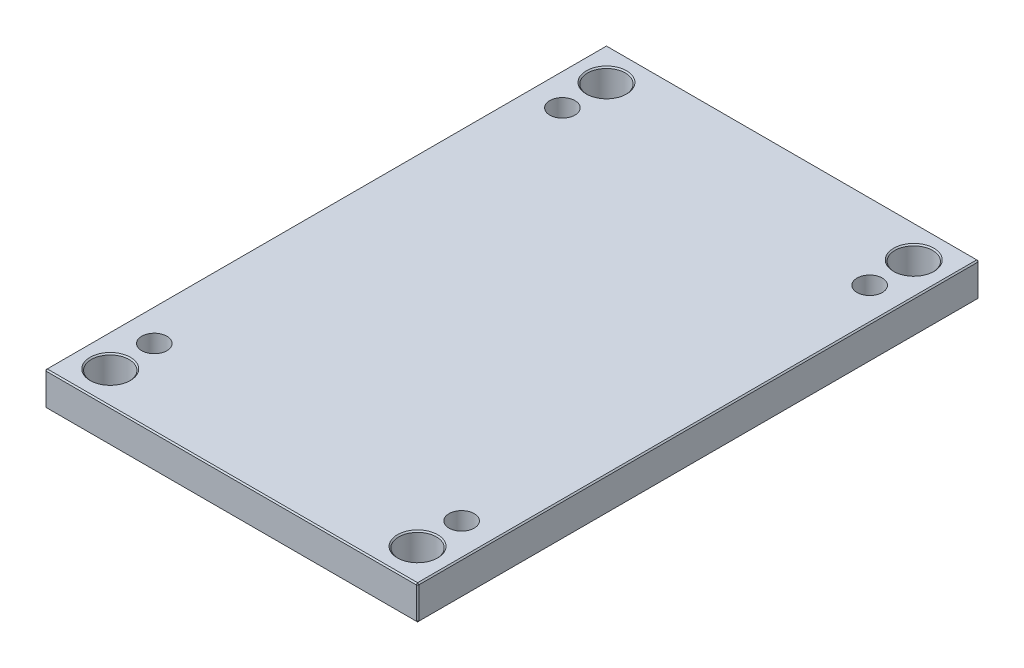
ISO-10303-21;
HEADER;
FILE_DESCRIPTION(('STEP AP214'),'2;1');
FILE_NAME('part.step','',(''),(''),'','','');
FILE_SCHEMA(('AUTOMOTIVE_DESIGN { 1 0 10303 214 1 1 1 1 }'));
ENDSEC;
DATA;
#1=APPLICATION_CONTEXT('core data for automotive mechanical design processes');
#2=APPLICATION_PROTOCOL_DEFINITION('international standard','automotive_design',2000,#1);
#3=PRODUCT_CONTEXT('',#1,'mechanical');
#4=PRODUCT('Part','Part','',(#3));
#5=PRODUCT_RELATED_PRODUCT_CATEGORY('part','',(#4));
#6=PRODUCT_DEFINITION_FORMATION('','',#4);
#7=PRODUCT_DEFINITION_CONTEXT('part definition',#1,'design');
#8=PRODUCT_DEFINITION('design','',#6,#7);
#9=PRODUCT_DEFINITION_SHAPE('','',#8);
#10=(LENGTH_UNIT() NAMED_UNIT(*) SI_UNIT(.MILLI.,.METRE.));
#11=(NAMED_UNIT(*) PLANE_ANGLE_UNIT() SI_UNIT($,.RADIAN.));
#12=(NAMED_UNIT(*) SI_UNIT($,.STERADIAN.) SOLID_ANGLE_UNIT());
#13=UNCERTAINTY_MEASURE_WITH_UNIT(LENGTH_MEASURE(1.E-05),#10,'distance_accuracy_value','');
#14=(GEOMETRIC_REPRESENTATION_CONTEXT(3) GLOBAL_UNCERTAINTY_ASSIGNED_CONTEXT((#13)) GLOBAL_UNIT_ASSIGNED_CONTEXT((#10,
#11,#12)) REPRESENTATION_CONTEXT('',''));
#15=CARTESIAN_POINT('',(0.,0.,0.));
#16=DIRECTION('',(0.,0.,1.));
#17=DIRECTION('',(1.,0.,0.));
#18=AXIS2_PLACEMENT_3D('',#15,#16,#17);
#19=CARTESIAN_POINT('',(-122.,0.,-162.));
#20=DIRECTION('',(0.,1.,0.));
#21=DIRECTION('',(0.,0.,1.));
#22=AXIS2_PLACEMENT_3D('',#19,#20,#21);
#23=CYLINDRICAL_SURFACE('',#22,6.);
#24=CARTESIAN_POINT('',(-122.,0.,-162.));
#25=DIRECTION('',(0.,1.,0.));
#26=DIRECTION('',(0.,0.,1.));
#27=AXIS2_PLACEMENT_3D('',#24,#25,#26);
#28=CIRCLE('',#27,6.);
#29=CARTESIAN_POINT('',(-122.,0.,-156.));
#30=VERTEX_POINT('',#29);
#31=EDGE_CURVE('E150',#30,#30,#28,.T.);
#32=ORIENTED_EDGE('',*,*,#31,.F.);
#33=EDGE_LOOP('',(#32));
#34=FACE_BOUND('',#33,.T.);
#35=CARTESIAN_POINT('',(-122.,13.,-162.));
#36=DIRECTION('',(0.,1.,0.));
#37=DIRECTION('',(0.,0.,1.));
#38=AXIS2_PLACEMENT_3D('',#35,#36,#37);
#39=CIRCLE('',#38,6.);
#40=CARTESIAN_POINT('',(-122.,13.,-156.));
#41=VERTEX_POINT('',#40);
#42=EDGE_CURVE('E20',#41,#41,#39,.F.);
#43=ORIENTED_EDGE('',*,*,#42,.F.);
#44=EDGE_LOOP('',(#43));
#45=FACE_BOUND('',#44,.T.);
#46=ADVANCED_FACE('F16',(#34,#45),#23,.F.);
#47=CARTESIAN_POINT('',(122.,0.,-162.));
#48=DIRECTION('',(0.,1.,0.));
#49=DIRECTION('',(0.,0.,1.));
#50=AXIS2_PLACEMENT_3D('',#47,#48,#49);
#51=CYLINDRICAL_SURFACE('',#50,6.);
#52=CARTESIAN_POINT('',(122.,0.,-162.));
#53=DIRECTION('',(0.,1.,0.));
#54=DIRECTION('',(0.,0.,1.));
#55=AXIS2_PLACEMENT_3D('',#52,#53,#54);
#56=CIRCLE('',#55,6.);
#57=CARTESIAN_POINT('',(122.,0.,-156.));
#58=VERTEX_POINT('',#57);
#59=EDGE_CURVE('E307',#58,#58,#56,.T.);
#60=ORIENTED_EDGE('',*,*,#59,.F.);
#61=EDGE_LOOP('',(#60));
#62=FACE_BOUND('',#61,.T.);
#63=CARTESIAN_POINT('',(122.,13.,-162.));
#64=DIRECTION('',(0.,1.,0.));
#65=DIRECTION('',(0.,0.,1.));
#66=AXIS2_PLACEMENT_3D('',#63,#64,#65);
#67=CIRCLE('',#66,6.);
#68=CARTESIAN_POINT('',(122.,13.,-156.));
#69=VERTEX_POINT('',#68);
#70=EDGE_CURVE('E294',#69,#69,#67,.F.);
#71=ORIENTED_EDGE('',*,*,#70,.F.);
#72=EDGE_LOOP('',(#71));
#73=FACE_BOUND('',#72,.T.);
#74=ADVANCED_FACE('F473',(#62,#73),#51,.F.);
#75=CARTESIAN_POINT('',(122.,0.,162.));
#76=DIRECTION('',(0.,1.,0.));
#77=DIRECTION('',(0.,0.,1.));
#78=AXIS2_PLACEMENT_3D('',#75,#76,#77);
#79=CYLINDRICAL_SURFACE('',#78,6.);
#80=CARTESIAN_POINT('',(122.,0.,162.));
#81=DIRECTION('',(0.,1.,0.));
#82=DIRECTION('',(0.,0.,1.));
#83=AXIS2_PLACEMENT_3D('',#80,#81,#82);
#84=CIRCLE('',#83,6.);
#85=CARTESIAN_POINT('',(122.,0.,168.));
#86=VERTEX_POINT('',#85);
#87=EDGE_CURVE('E303',#86,#86,#84,.T.);
#88=ORIENTED_EDGE('',*,*,#87,.F.);
#89=EDGE_LOOP('',(#88));
#90=FACE_BOUND('',#89,.T.);
#91=CARTESIAN_POINT('',(122.,13.,162.));
#92=DIRECTION('',(0.,1.,0.));
#93=DIRECTION('',(0.,0.,1.));
#94=AXIS2_PLACEMENT_3D('',#91,#92,#93);
#95=CIRCLE('',#94,6.);
#96=CARTESIAN_POINT('',(122.,13.,168.));
#97=VERTEX_POINT('',#96);
#98=EDGE_CURVE('E291',#97,#97,#95,.F.);
#99=ORIENTED_EDGE('',*,*,#98,.F.);
#100=EDGE_LOOP('',(#99));
#101=FACE_BOUND('',#100,.T.);
#102=ADVANCED_FACE('F480',(#90,#101),#79,.F.);
#103=CARTESIAN_POINT('',(-122.,0.,162.));
#104=DIRECTION('',(0.,1.,0.));
#105=DIRECTION('',(0.,0.,1.));
#106=AXIS2_PLACEMENT_3D('',#103,#104,#105);
#107=CYLINDRICAL_SURFACE('',#106,6.);
#108=CARTESIAN_POINT('',(-122.,0.,162.));
#109=DIRECTION('',(0.,1.,0.));
#110=DIRECTION('',(0.,0.,1.));
#111=AXIS2_PLACEMENT_3D('',#108,#109,#110);
#112=CIRCLE('',#111,6.);
#113=CARTESIAN_POINT('',(-122.,0.,168.));
#114=VERTEX_POINT('',#113);
#115=EDGE_CURVE('E299',#114,#114,#112,.T.);
#116=ORIENTED_EDGE('',*,*,#115,.F.);
#117=EDGE_LOOP('',(#116));
#118=FACE_BOUND('',#117,.T.);
#119=CARTESIAN_POINT('',(-122.,13.,162.));
#120=DIRECTION('',(0.,1.,0.));
#121=DIRECTION('',(0.,0.,1.));
#122=AXIS2_PLACEMENT_3D('',#119,#120,#121);
#123=CIRCLE('',#122,6.);
#124=CARTESIAN_POINT('',(-122.,13.,168.));
#125=VERTEX_POINT('',#124);
#126=EDGE_CURVE('E288',#125,#125,#123,.F.);
#127=ORIENTED_EDGE('',*,*,#126,.F.);
#128=EDGE_LOOP('',(#127));
#129=FACE_BOUND('',#128,.T.);
#130=ADVANCED_FACE('F485',(#118,#129),#107,.F.);
#131=CARTESIAN_POINT('',(-148.,27.,223.));
#132=DIRECTION('',(1.,0.,0.));
#133=DIRECTION('',(0.,0.,-1.));
#134=AXIS2_PLACEMENT_3D('',#131,#132,#133);
#135=PLANE('',#134);
#136=DIRECTION('',(0.,-1.,0.));
#137=VECTOR('',#136,1.);
#138=CARTESIAN_POINT('',(-148.,27.,-222.));
#139=LINE('',#138,#137);
#140=CARTESIAN_POINT('',(-148.,26.,-222.));
#141=VERTEX_POINT('',#140);
#142=CARTESIAN_POINT('',(-148.,1.,-222.));
#143=VERTEX_POINT('',#142);
#144=EDGE_CURVE('E118',#141,#143,#139,.T.);
#145=ORIENTED_EDGE('',*,*,#144,.T.);
#146=DIRECTION('',(0.,0.,1.));
#147=VECTOR('',#146,1.);
#148=CARTESIAN_POINT('',(-148.,1.,223.));
#149=LINE('',#148,#147);
#150=CARTESIAN_POINT('',(-148.,1.,222.));
#151=VERTEX_POINT('',#150);
#152=EDGE_CURVE('E114',#143,#151,#149,.T.);
#153=ORIENTED_EDGE('',*,*,#152,.T.);
#154=DIRECTION('',(0.,1.,0.));
#155=VECTOR('',#154,1.);
#156=CARTESIAN_POINT('',(-148.,27.,222.));
#157=LINE('',#156,#155);
#158=CARTESIAN_POINT('',(-148.,26.,222.));
#159=VERTEX_POINT('',#158);
#160=EDGE_CURVE('E106',#151,#159,#157,.T.);
#161=ORIENTED_EDGE('',*,*,#160,.T.);
#162=DIRECTION('',(0.,0.,-1.));
#163=VECTOR('',#162,1.);
#164=CARTESIAN_POINT('',(-148.,26.,-223.));
#165=LINE('',#164,#163);
#166=EDGE_CURVE('E111',#159,#141,#165,.T.);
#167=ORIENTED_EDGE('',*,*,#166,.T.);
#168=EDGE_LOOP('',(#145,#153,#161,#167));
#169=FACE_BOUND('',#168,.T.);
#170=ADVANCED_FACE('F109',(#169),#135,.F.);
#171=CARTESIAN_POINT('',(148.,27.,223.));
#172=DIRECTION('',(0.,0.,-1.));
#173=DIRECTION('',(-1.,0.,0.));
#174=AXIS2_PLACEMENT_3D('',#171,#172,#173);
#175=PLANE('',#174);
#176=DIRECTION('',(-1.,0.,0.));
#177=VECTOR('',#176,1.);
#178=CARTESIAN_POINT('',(-148.,26.,223.));
#179=LINE('',#178,#177);
#180=CARTESIAN_POINT('',(147.,26.,223.));
#181=VERTEX_POINT('',#180);
#182=CARTESIAN_POINT('',(-147.,26.,223.));
#183=VERTEX_POINT('',#182);
#184=EDGE_CURVE('E173',#181,#183,#179,.T.);
#185=ORIENTED_EDGE('',*,*,#184,.T.);
#186=DIRECTION('',(0.,-1.,0.));
#187=VECTOR('',#186,1.);
#188=CARTESIAN_POINT('',(-147.,27.,223.));
#189=LINE('',#188,#187);
#190=CARTESIAN_POINT('',(-147.,0.999999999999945,223.));
#191=VERTEX_POINT('',#190);
#192=EDGE_CURVE('E126',#183,#191,#189,.T.);
#193=ORIENTED_EDGE('',*,*,#192,.T.);
#194=DIRECTION('',(1.,0.,0.));
#195=VECTOR('',#194,1.);
#196=CARTESIAN_POINT('',(148.,0.999999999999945,223.));
#197=LINE('',#196,#195);
#198=CARTESIAN_POINT('',(147.,0.999999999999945,223.));
#199=VERTEX_POINT('',#198);
#200=EDGE_CURVE('E177',#191,#199,#197,.T.);
#201=ORIENTED_EDGE('',*,*,#200,.T.);
#202=DIRECTION('',(0.,1.,0.));
#203=VECTOR('',#202,1.);
#204=CARTESIAN_POINT('',(147.,27.,223.));
#205=LINE('',#204,#203);
#206=EDGE_CURVE('E175',#199,#181,#205,.T.);
#207=ORIENTED_EDGE('',*,*,#206,.T.);
#208=EDGE_LOOP('',(#185,#193,#201,#207));
#209=FACE_BOUND('',#208,.T.);
#210=ADVANCED_FACE('F438',(#209),#175,.F.);
#211=CARTESIAN_POINT('',(148.,27.,223.));
#212=DIRECTION('',(-1.,0.,0.));
#213=DIRECTION('',(0.,0.,1.));
#214=AXIS2_PLACEMENT_3D('',#211,#212,#213);
#215=PLANE('',#214);
#216=DIRECTION('',(0.,0.,-1.));
#217=VECTOR('',#216,1.);
#218=CARTESIAN_POINT('',(148.,0.999999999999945,223.));
#219=LINE('',#218,#217);
#220=CARTESIAN_POINT('',(148.,0.999999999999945,222.));
#221=VERTEX_POINT('',#220);
#222=CARTESIAN_POINT('',(148.,0.999999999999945,-222.));
#223=VERTEX_POINT('',#222);
#224=EDGE_CURVE('E168',#221,#223,#219,.T.);
#225=ORIENTED_EDGE('',*,*,#224,.T.);
#226=DIRECTION('',(0.,1.,0.));
#227=VECTOR('',#226,1.);
#228=CARTESIAN_POINT('',(148.,27.,-222.));
#229=LINE('',#228,#227);
#230=CARTESIAN_POINT('',(148.,26.,-222.));
#231=VERTEX_POINT('',#230);
#232=EDGE_CURVE('E170',#223,#231,#229,.T.);
#233=ORIENTED_EDGE('',*,*,#232,.T.);
#234=DIRECTION('',(0.,0.,1.));
#235=VECTOR('',#234,1.);
#236=CARTESIAN_POINT('',(148.,26.,223.));
#237=LINE('',#236,#235);
#238=CARTESIAN_POINT('',(148.,26.,222.));
#239=VERTEX_POINT('',#238);
#240=EDGE_CURVE('E164',#231,#239,#237,.T.);
#241=ORIENTED_EDGE('',*,*,#240,.T.);
#242=DIRECTION('',(0.,-1.,0.));
#243=VECTOR('',#242,1.);
#244=CARTESIAN_POINT('',(148.,27.,222.));
#245=LINE('',#244,#243);
#246=EDGE_CURVE('E166',#239,#221,#245,.T.);
#247=ORIENTED_EDGE('',*,*,#246,.T.);
#248=EDGE_LOOP('',(#225,#233,#241,#247));
#249=FACE_BOUND('',#248,.T.);
#250=ADVANCED_FACE('F431',(#249),#215,.F.);
#251=CARTESIAN_POINT('',(148.,27.,-223.));
#252=DIRECTION('',(0.,0.,1.));
#253=DIRECTION('',(1.,0.,0.));
#254=AXIS2_PLACEMENT_3D('',#251,#252,#253);
#255=PLANE('',#254);
#256=DIRECTION('',(0.,-1.,0.));
#257=VECTOR('',#256,1.);
#258=CARTESIAN_POINT('',(147.,27.,-223.));
#259=LINE('',#258,#257);
#260=CARTESIAN_POINT('',(147.,26.,-223.));
#261=VERTEX_POINT('',#260);
#262=CARTESIAN_POINT('',(147.,0.999999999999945,-223.));
#263=VERTEX_POINT('',#262);
#264=EDGE_CURVE('E157',#261,#263,#259,.T.);
#265=ORIENTED_EDGE('',*,*,#264,.T.);
#266=DIRECTION('',(-1.,0.,0.));
#267=VECTOR('',#266,1.);
#268=CARTESIAN_POINT('',(148.,0.999999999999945,-223.));
#269=LINE('',#268,#267);
#270=CARTESIAN_POINT('',(-147.,0.999999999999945,-223.));
#271=VERTEX_POINT('',#270);
#272=EDGE_CURVE('E162',#263,#271,#269,.T.);
#273=ORIENTED_EDGE('',*,*,#272,.T.);
#274=DIRECTION('',(0.,1.,0.));
#275=VECTOR('',#274,1.);
#276=CARTESIAN_POINT('',(-147.,27.,-223.));
#277=LINE('',#276,#275);
#278=CARTESIAN_POINT('',(-147.,26.,-223.));
#279=VERTEX_POINT('',#278);
#280=EDGE_CURVE('E159',#271,#279,#277,.T.);
#281=ORIENTED_EDGE('',*,*,#280,.T.);
#282=DIRECTION('',(1.,0.,0.));
#283=VECTOR('',#282,1.);
#284=CARTESIAN_POINT('',(148.,26.,-223.));
#285=LINE('',#284,#283);
#286=EDGE_CURVE('E155',#279,#261,#285,.T.);
#287=ORIENTED_EDGE('',*,*,#286,.T.);
#288=EDGE_LOOP('',(#265,#273,#281,#287));
#289=FACE_BOUND('',#288,.T.);
#290=ADVANCED_FACE('F349',(#289),#255,.F.);
#291=CARTESIAN_POINT('',(0.,27.,0.));
#292=DIRECTION('',(0.,1.,0.));
#293=DIRECTION('',(0.,0.,1.));
#294=AXIS2_PLACEMENT_3D('',#291,#292,#293);
#295=PLANE('',#294);
#296=CARTESIAN_POINT('',(-122.,27.,162.));
#297=DIRECTION('',(0.,1.,0.));
#298=DIRECTION('',(0.,0.,1.));
#299=AXIS2_PLACEMENT_3D('',#296,#297,#298);
#300=CIRCLE('',#299,10.);
#301=CARTESIAN_POINT('',(-122.,27.,172.));
#302=VERTEX_POINT('',#301);
#303=EDGE_CURVE('E318',#302,#302,#300,.T.);
#304=ORIENTED_EDGE('',*,*,#303,.F.);
#305=EDGE_LOOP('',(#304));
#306=FACE_BOUND('',#305,.T.);
#307=CARTESIAN_POINT('',(122.,27.,162.));
#308=DIRECTION('',(0.,1.,0.));
#309=DIRECTION('',(0.,0.,1.));
#310=AXIS2_PLACEMENT_3D('',#307,#308,#309);
#311=CIRCLE('',#310,10.);
#312=CARTESIAN_POINT('',(122.,27.,172.));
#313=VERTEX_POINT('',#312);
#314=EDGE_CURVE('E324',#313,#313,#311,.T.);
#315=ORIENTED_EDGE('',*,*,#314,.F.);
#316=EDGE_LOOP('',(#315));
#317=FACE_BOUND('',#316,.T.);
#318=CARTESIAN_POINT('',(122.,27.,-162.));
#319=DIRECTION('',(0.,1.,0.));
#320=DIRECTION('',(0.,0.,1.));
#321=AXIS2_PLACEMENT_3D('',#318,#319,#320);
#322=CIRCLE('',#321,10.);
#323=CARTESIAN_POINT('',(122.,27.,-152.));
#324=VERTEX_POINT('',#323);
#325=EDGE_CURVE('E330',#324,#324,#322,.T.);
#326=ORIENTED_EDGE('',*,*,#325,.F.);
#327=EDGE_LOOP('',(#326));
#328=FACE_BOUND('',#327,.T.);
#329=CARTESIAN_POINT('',(-122.,27.,-162.));
#330=DIRECTION('',(0.,1.,0.));
#331=DIRECTION('',(0.,0.,1.));
#332=AXIS2_PLACEMENT_3D('',#329,#330,#331);
#333=CIRCLE('',#332,10.);
#334=CARTESIAN_POINT('',(-122.,27.,-152.));
#335=VERTEX_POINT('',#334);
#336=EDGE_CURVE('E312',#335,#335,#333,.T.);
#337=ORIENTED_EDGE('',*,*,#336,.F.);
#338=EDGE_LOOP('',(#337));
#339=FACE_BOUND('',#338,.T.);
#340=CARTESIAN_POINT('',(-122.,27.,197.));
#341=DIRECTION('',(0.,1.,0.));
#342=DIRECTION('',(0.,0.,1.));
#343=AXIS2_PLACEMENT_3D('',#340,#341,#342);
#344=CIRCLE('',#343,16.);
#345=CARTESIAN_POINT('',(-122.,27.,213.));
#346=VERTEX_POINT('',#345);
#347=EDGE_CURVE('E259',#346,#346,#344,.F.);
#348=ORIENTED_EDGE('',*,*,#347,.T.);
#349=EDGE_LOOP('',(#348));
#350=FACE_BOUND('',#349,.T.);
#351=CARTESIAN_POINT('',(122.,27.,197.));
#352=DIRECTION('',(0.,1.,0.));
#353=DIRECTION('',(0.,0.,1.));
#354=AXIS2_PLACEMENT_3D('',#351,#352,#353);
#355=CIRCLE('',#354,16.);
#356=CARTESIAN_POINT('',(122.,27.,213.));
#357=VERTEX_POINT('',#356);
#358=EDGE_CURVE('E256',#357,#357,#355,.F.);
#359=ORIENTED_EDGE('',*,*,#358,.T.);
#360=EDGE_LOOP('',(#359));
#361=FACE_BOUND('',#360,.T.);
#362=CARTESIAN_POINT('',(122.,27.,-197.));
#363=DIRECTION('',(0.,1.,0.));
#364=DIRECTION('',(0.,0.,1.));
#365=AXIS2_PLACEMENT_3D('',#362,#363,#364);
#366=CIRCLE('',#365,16.);
#367=CARTESIAN_POINT('',(122.,27.,-181.));
#368=VERTEX_POINT('',#367);
#369=EDGE_CURVE('E253',#368,#368,#366,.F.);
#370=ORIENTED_EDGE('',*,*,#369,.T.);
#371=EDGE_LOOP('',(#370));
#372=FACE_BOUND('',#371,.T.);
#373=CARTESIAN_POINT('',(-122.,27.,-197.));
#374=DIRECTION('',(0.,1.,0.));
#375=DIRECTION('',(0.,0.,1.));
#376=AXIS2_PLACEMENT_3D('',#373,#374,#375);
#377=CIRCLE('',#376,16.);
#378=CARTESIAN_POINT('',(-122.,27.,-181.));
#379=VERTEX_POINT('',#378);
#380=EDGE_CURVE('E250',#379,#379,#377,.F.);
#381=ORIENTED_EDGE('',*,*,#380,.T.);
#382=EDGE_LOOP('',(#381));
#383=FACE_BOUND('',#382,.T.);
#384=DIRECTION('',(0.,0.,-1.));
#385=VECTOR('',#384,1.);
#386=CARTESIAN_POINT('',(147.,27.,-223.));
#387=LINE('',#386,#385);
#388=CARTESIAN_POINT('',(147.,27.,222.));
#389=VERTEX_POINT('',#388);
#390=CARTESIAN_POINT('',(147.,27.,-222.));
#391=VERTEX_POINT('',#390);
#392=EDGE_CURVE('E33',#389,#391,#387,.T.);
#393=ORIENTED_EDGE('',*,*,#392,.T.);
#394=DIRECTION('',(-1.,0.,0.));
#395=VECTOR('',#394,1.);
#396=CARTESIAN_POINT('',(-148.,27.,-222.));
#397=LINE('',#396,#395);
#398=CARTESIAN_POINT('',(-147.,27.,-222.));
#399=VERTEX_POINT('',#398);
#400=EDGE_CURVE('E193',#391,#399,#397,.T.);
#401=ORIENTED_EDGE('',*,*,#400,.T.);
#402=DIRECTION('',(0.,0.,1.));
#403=VECTOR('',#402,1.);
#404=CARTESIAN_POINT('',(-147.,27.,223.));
#405=LINE('',#404,#403);
#406=CARTESIAN_POINT('',(-147.,27.,222.));
#407=VERTEX_POINT('',#406);
#408=EDGE_CURVE('E189',#399,#407,#405,.T.);
#409=ORIENTED_EDGE('',*,*,#408,.T.);
#410=DIRECTION('',(1.,0.,0.));
#411=VECTOR('',#410,1.);
#412=CARTESIAN_POINT('',(148.,27.,222.));
#413=LINE('',#412,#411);
#414=EDGE_CURVE('E38',#407,#389,#413,.T.);
#415=ORIENTED_EDGE('',*,*,#414,.T.);
#416=EDGE_LOOP('',(#393,#401,#409,#415));
#417=FACE_BOUND('',#416,.T.);
#418=ADVANCED_FACE('F345',(#306,#317,#328,#339,#350,#361,#372,#383,#417),#295,.T.);
#419=CARTESIAN_POINT('',(0.,0.,0.));
#420=DIRECTION('',(0.,1.,0.));
#421=DIRECTION('',(0.,0.,1.));
#422=AXIS2_PLACEMENT_3D('',#419,#420,#421);
#423=PLANE('',#422);
#424=CARTESIAN_POINT('',(-122.,0.,197.));
#425=DIRECTION('',(0.,1.,0.));
#426=DIRECTION('',(0.,0.,1.));
#427=AXIS2_PLACEMENT_3D('',#424,#425,#426);
#428=CIRCLE('',#427,16.);
#429=CARTESIAN_POINT('',(-122.,0.,213.));
#430=VERTEX_POINT('',#429);
#431=EDGE_CURVE('E271',#430,#430,#428,.T.);
#432=ORIENTED_EDGE('',*,*,#431,.T.);
#433=EDGE_LOOP('',(#432));
#434=FACE_BOUND('',#433,.T.);
#435=CARTESIAN_POINT('',(122.,0.,197.));
#436=DIRECTION('',(0.,1.,0.));
#437=DIRECTION('',(0.,0.,1.));
#438=AXIS2_PLACEMENT_3D('',#435,#436,#437);
#439=CIRCLE('',#438,16.);
#440=CARTESIAN_POINT('',(122.,0.,213.));
#441=VERTEX_POINT('',#440);
#442=EDGE_CURVE('E268',#441,#441,#439,.T.);
#443=ORIENTED_EDGE('',*,*,#442,.T.);
#444=EDGE_LOOP('',(#443));
#445=FACE_BOUND('',#444,.T.);
#446=CARTESIAN_POINT('',(122.,0.,-197.));
#447=DIRECTION('',(0.,1.,0.));
#448=DIRECTION('',(0.,0.,1.));
#449=AXIS2_PLACEMENT_3D('',#446,#447,#448);
#450=CIRCLE('',#449,16.);
#451=CARTESIAN_POINT('',(122.,0.,-181.));
#452=VERTEX_POINT('',#451);
#453=EDGE_CURVE('E265',#452,#452,#450,.T.);
#454=ORIENTED_EDGE('',*,*,#453,.T.);
#455=EDGE_LOOP('',(#454));
#456=FACE_BOUND('',#455,.T.);
#457=CARTESIAN_POINT('',(-122.,0.,-197.));
#458=DIRECTION('',(0.,1.,0.));
#459=DIRECTION('',(0.,0.,1.));
#460=AXIS2_PLACEMENT_3D('',#457,#458,#459);
#461=CIRCLE('',#460,16.);
#462=CARTESIAN_POINT('',(-122.,0.,-181.));
#463=VERTEX_POINT('',#462);
#464=EDGE_CURVE('E262',#463,#463,#461,.T.);
#465=ORIENTED_EDGE('',*,*,#464,.T.);
#466=EDGE_LOOP('',(#465));
#467=FACE_BOUND('',#466,.T.);
#468=ORIENTED_EDGE('',*,*,#115,.T.);
#469=EDGE_LOOP('',(#468));
#470=FACE_BOUND('',#469,.T.);
#471=ORIENTED_EDGE('',*,*,#87,.T.);
#472=EDGE_LOOP('',(#471));
#473=FACE_BOUND('',#472,.T.);
#474=ORIENTED_EDGE('',*,*,#59,.T.);
#475=EDGE_LOOP('',(#474));
#476=FACE_BOUND('',#475,.T.);
#477=ORIENTED_EDGE('',*,*,#31,.T.);
#478=EDGE_LOOP('',(#477));
#479=FACE_BOUND('',#478,.T.);
#480=DIRECTION('',(0.,0.,1.));
#481=VECTOR('',#480,1.);
#482=CARTESIAN_POINT('',(147.,0.,0.));
#483=LINE('',#482,#481);
#484=CARTESIAN_POINT('',(147.,0.,-222.));
#485=VERTEX_POINT('',#484);
#486=CARTESIAN_POINT('',(147.,0.,222.));
#487=VERTEX_POINT('',#486);
#488=EDGE_CURVE('E180',#485,#487,#483,.T.);
#489=ORIENTED_EDGE('',*,*,#488,.T.);
#490=DIRECTION('',(-1.,0.,0.));
#491=VECTOR('',#490,1.);
#492=CARTESIAN_POINT('',(0.,0.,222.));
#493=LINE('',#492,#491);
#494=CARTESIAN_POINT('',(-147.,0.,222.));
#495=VERTEX_POINT('',#494);
#496=EDGE_CURVE('E186',#487,#495,#493,.T.);
#497=ORIENTED_EDGE('',*,*,#496,.T.);
#498=DIRECTION('',(0.,0.,-1.));
#499=VECTOR('',#498,1.);
#500=CARTESIAN_POINT('',(-147.,0.,0.));
#501=LINE('',#500,#499);
#502=CARTESIAN_POINT('',(-147.,0.,-222.));
#503=VERTEX_POINT('',#502);
#504=EDGE_CURVE('E184',#495,#503,#501,.T.);
#505=ORIENTED_EDGE('',*,*,#504,.T.);
#506=DIRECTION('',(1.,0.,0.));
#507=VECTOR('',#506,1.);
#508=CARTESIAN_POINT('',(0.,0.,-222.));
#509=LINE('',#508,#507);
#510=EDGE_CURVE('E182',#503,#485,#509,.T.);
#511=ORIENTED_EDGE('',*,*,#510,.T.);
#512=EDGE_LOOP('',(#489,#497,#505,#511));
#513=FACE_BOUND('',#512,.T.);
#514=ADVANCED_FACE('F348',(#434,#445,#456,#467,#470,#473,#476,#479,#513),#423,.F.);
#515=CARTESIAN_POINT('',(148.,27.,222.));
#516=DIRECTION('',(-0.707106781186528,0.,-0.707106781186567));
#517=DIRECTION('',(0.,-1.,0.));
#518=AXIS2_PLACEMENT_3D('',#515,#516,#517);
#519=PLANE('',#518);
#520=DIRECTION('',(-0.707106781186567,0.,0.707106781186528));
#521=VECTOR('',#520,1.);
#522=CARTESIAN_POINT('',(147.,26.,223.));
#523=LINE('',#522,#521);
#524=EDGE_CURVE('E144',#181,#239,#523,.F.);
#525=ORIENTED_EDGE('',*,*,#524,.F.);
#526=ORIENTED_EDGE('',*,*,#206,.F.);
#527=DIRECTION('',(0.707106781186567,0.,-0.707106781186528));
#528=VECTOR('',#527,1.);
#529=CARTESIAN_POINT('',(147.,0.999999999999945,223.));
#530=LINE('',#529,#528);
#531=EDGE_CURVE('E147',#221,#199,#530,.F.);
#532=ORIENTED_EDGE('',*,*,#531,.F.);
#533=ORIENTED_EDGE('',*,*,#246,.F.);
#534=EDGE_LOOP('',(#525,#526,#532,#533));
#535=FACE_BOUND('',#534,.T.);
#536=ADVANCED_FACE('F382',(#535),#519,.F.);
#537=CARTESIAN_POINT('',(147.,26.,223.));
#538=DIRECTION('',(0.577350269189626,0.577350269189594,0.577350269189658));
#539=DIRECTION('',(0.707106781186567,0.,-0.707106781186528));
#540=AXIS2_PLACEMENT_3D('',#537,#538,#539);
#541=PLANE('',#540);
#542=DIRECTION('',(0.,-0.707106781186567,0.707106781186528));
#543=VECTOR('',#542,1.);
#544=CARTESIAN_POINT('',(147.,26.,223.));
#545=LINE('',#544,#543);
#546=EDGE_CURVE('E238',#181,#389,#545,.F.);
#547=ORIENTED_EDGE('',*,*,#546,.F.);
#548=ORIENTED_EDGE('',*,*,#524,.T.);
#549=DIRECTION('',(-0.707106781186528,0.707106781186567,0.));
#550=VECTOR('',#549,1.);
#551=CARTESIAN_POINT('',(147.5,26.5,222.));
#552=LINE('',#551,#550);
#553=EDGE_CURVE('E240',#389,#239,#552,.F.);
#554=ORIENTED_EDGE('',*,*,#553,.F.);
#555=EDGE_LOOP('',(#547,#548,#554));
#556=FACE_BOUND('',#555,.T.);
#557=ADVANCED_FACE('F444',(#556),#541,.T.);
#558=CARTESIAN_POINT('',(147.,0.999999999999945,223.));
#559=DIRECTION('',(0.577350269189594,-0.577350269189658,0.577350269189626));
#560=DIRECTION('',(0.,-0.707106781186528,-0.707106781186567));
#561=AXIS2_PLACEMENT_3D('',#558,#559,#560);
#562=PLANE('',#561);
#563=DIRECTION('',(-0.707106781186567,-0.707106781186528,0.));
#564=VECTOR('',#563,1.);
#565=CARTESIAN_POINT('',(147.5,0.499999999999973,222.));
#566=LINE('',#565,#564);
#567=EDGE_CURVE('E232',#221,#487,#566,.T.);
#568=ORIENTED_EDGE('',*,*,#567,.F.);
#569=ORIENTED_EDGE('',*,*,#531,.T.);
#570=DIRECTION('',(0.,0.707106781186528,0.707106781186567));
#571=VECTOR('',#570,1.);
#572=CARTESIAN_POINT('',(147.,0.999999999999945,223.));
#573=LINE('',#572,#571);
#574=EDGE_CURVE('E235',#487,#199,#573,.T.);
#575=ORIENTED_EDGE('',*,*,#574,.F.);
#576=EDGE_LOOP('',(#568,#569,#575));
#577=FACE_BOUND('',#576,.T.);
#578=ADVANCED_FACE('F403',(#577),#562,.T.);
#579=CARTESIAN_POINT('',(147.,27.,0.));
#580=DIRECTION('',(0.707106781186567,0.707106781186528,0.));
#581=DIRECTION('',(0.,0.,1.));
#582=AXIS2_PLACEMENT_3D('',#579,#580,#581);
#583=PLANE('',#582);
#584=ORIENTED_EDGE('',*,*,#553,.T.);
#585=ORIENTED_EDGE('',*,*,#240,.F.);
#586=DIRECTION('',(0.707106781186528,-0.707106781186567,0.));
#587=VECTOR('',#586,1.);
#588=CARTESIAN_POINT('',(148.,26.,-222.));
#589=LINE('',#588,#587);
#590=EDGE_CURVE('E227',#391,#231,#589,.T.);
#591=ORIENTED_EDGE('',*,*,#590,.F.);
#592=ORIENTED_EDGE('',*,*,#392,.F.);
#593=EDGE_LOOP('',(#584,#585,#591,#592));
#594=FACE_BOUND('',#593,.T.);
#595=ADVANCED_FACE('F446',(#594),#583,.T.);
#596=CARTESIAN_POINT('',(0.,27.,222.));
#597=DIRECTION('',(0.,0.707106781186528,0.707106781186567));
#598=DIRECTION('',(-1.,0.,0.));
#599=AXIS2_PLACEMENT_3D('',#596,#597,#598);
#600=PLANE('',#599);
#601=ORIENTED_EDGE('',*,*,#546,.T.);
#602=ORIENTED_EDGE('',*,*,#414,.F.);
#603=DIRECTION('',(0.,0.707106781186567,-0.707106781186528));
#604=VECTOR('',#603,1.);
#605=CARTESIAN_POINT('',(-147.,26.5,222.5));
#606=LINE('',#605,#604);
#607=EDGE_CURVE('E130',#183,#407,#606,.T.);
#608=ORIENTED_EDGE('',*,*,#607,.F.);
#609=ORIENTED_EDGE('',*,*,#184,.F.);
#610=EDGE_LOOP('',(#601,#602,#608,#609));
#611=FACE_BOUND('',#610,.T.);
#612=ADVANCED_FACE('F441',(#611),#600,.T.);
#613=CARTESIAN_POINT('',(-147.,27.,223.));
#614=DIRECTION('',(0.707106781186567,0.,-0.707106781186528));
#615=DIRECTION('',(0.,-1.,0.));
#616=AXIS2_PLACEMENT_3D('',#613,#614,#615);
#617=PLANE('',#616);
#618=DIRECTION('',(0.707106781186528,0.,0.707106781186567));
#619=VECTOR('',#618,1.);
#620=CARTESIAN_POINT('',(-147.,0.999999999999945,223.));
#621=LINE('',#620,#619);
#622=EDGE_CURVE('E131',#191,#151,#621,.F.);
#623=ORIENTED_EDGE('',*,*,#622,.F.);
#624=ORIENTED_EDGE('',*,*,#192,.F.);
#625=DIRECTION('',(-0.707106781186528,0.,-0.707106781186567));
#626=VECTOR('',#625,1.);
#627=CARTESIAN_POINT('',(-148.,26.,222.));
#628=LINE('',#627,#626);
#629=EDGE_CURVE('E122',#159,#183,#628,.F.);
#630=ORIENTED_EDGE('',*,*,#629,.F.);
#631=ORIENTED_EDGE('',*,*,#160,.F.);
#632=EDGE_LOOP('',(#623,#624,#630,#631));
#633=FACE_BOUND('',#632,.T.);
#634=ADVANCED_FACE('F124',(#633),#617,.F.);
#635=CARTESIAN_POINT('',(148.,0.999999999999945,223.));
#636=DIRECTION('',(0.,0.707106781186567,-0.707106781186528));
#637=DIRECTION('',(1.,0.,0.));
#638=AXIS2_PLACEMENT_3D('',#635,#636,#637);
#639=PLANE('',#638);
#640=ORIENTED_EDGE('',*,*,#574,.T.);
#641=ORIENTED_EDGE('',*,*,#200,.F.);
#642=DIRECTION('',(0.,-0.707106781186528,-0.707106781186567));
#643=VECTOR('',#642,1.);
#644=CARTESIAN_POINT('',(-147.,0.999999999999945,223.));
#645=LINE('',#644,#643);
#646=EDGE_CURVE('E223',#495,#191,#645,.F.);
#647=ORIENTED_EDGE('',*,*,#646,.F.);
#648=ORIENTED_EDGE('',*,*,#496,.F.);
#649=EDGE_LOOP('',(#640,#641,#647,#648));
#650=FACE_BOUND('',#649,.T.);
#651=ADVANCED_FACE('F408',(#650),#639,.F.);
#652=CARTESIAN_POINT('',(148.,0.999999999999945,223.));
#653=DIRECTION('',(-0.707106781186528,0.707106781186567,0.));
#654=DIRECTION('',(0.,0.,-1.));
#655=AXIS2_PLACEMENT_3D('',#652,#653,#654);
#656=PLANE('',#655);
#657=ORIENTED_EDGE('',*,*,#567,.T.);
#658=ORIENTED_EDGE('',*,*,#488,.F.);
#659=DIRECTION('',(0.707106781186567,0.707106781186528,0.));
#660=VECTOR('',#659,1.);
#661=CARTESIAN_POINT('',(147.5,0.499999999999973,-222.));
#662=LINE('',#661,#660);
#663=EDGE_CURVE('E220',#223,#485,#662,.F.);
#664=ORIENTED_EDGE('',*,*,#663,.F.);
#665=ORIENTED_EDGE('',*,*,#224,.F.);
#666=EDGE_LOOP('',(#657,#658,#664,#665));
#667=FACE_BOUND('',#666,.T.);
#668=ADVANCED_FACE('F401',(#667),#656,.F.);
#669=CARTESIAN_POINT('',(147.,27.,-223.));
#670=DIRECTION('',(-0.707106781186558,0.,0.707106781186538));
#671=DIRECTION('',(0.,-1.,0.));
#672=AXIS2_PLACEMENT_3D('',#669,#670,#671);
#673=PLANE('',#672);
#674=DIRECTION('',(0.707106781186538,0.,0.707106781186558));
#675=VECTOR('',#674,1.);
#676=CARTESIAN_POINT('',(148.,26.,-222.));
#677=LINE('',#676,#675);
#678=EDGE_CURVE('E229',#231,#261,#677,.F.);
#679=ORIENTED_EDGE('',*,*,#678,.F.);
#680=ORIENTED_EDGE('',*,*,#232,.F.);
#681=DIRECTION('',(-0.707106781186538,0.,-0.707106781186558));
#682=VECTOR('',#681,1.);
#683=CARTESIAN_POINT('',(147.,0.999999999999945,-223.));
#684=LINE('',#683,#682);
#685=EDGE_CURVE('E217',#263,#223,#684,.F.);
#686=ORIENTED_EDGE('',*,*,#685,.F.);
#687=ORIENTED_EDGE('',*,*,#264,.F.);
#688=EDGE_LOOP('',(#679,#680,#686,#687));
#689=FACE_BOUND('',#688,.T.);
#690=ADVANCED_FACE('F428',(#689),#673,.F.);
#691=CARTESIAN_POINT('',(148.,26.,-222.));
#692=DIRECTION('',(0.577350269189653,0.577350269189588,-0.577350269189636));
#693=DIRECTION('',(-0.707106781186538,0.,-0.707106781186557));
#694=AXIS2_PLACEMENT_3D('',#691,#692,#693);
#695=PLANE('',#694);
#696=ORIENTED_EDGE('',*,*,#590,.T.);
#697=ORIENTED_EDGE('',*,*,#678,.T.);
#698=DIRECTION('',(0.,0.707106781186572,0.707106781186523));
#699=VECTOR('',#698,1.);
#700=CARTESIAN_POINT('',(147.,26.5,-222.5));
#701=LINE('',#700,#699);
#702=EDGE_CURVE('E138',#391,#261,#701,.F.);
#703=ORIENTED_EDGE('',*,*,#702,.F.);
#704=EDGE_LOOP('',(#696,#697,#703));
#705=FACE_BOUND('',#704,.T.);
#706=ADVANCED_FACE('F450',(#705),#695,.T.);
#707=CARTESIAN_POINT('',(-148.,26.,222.));
#708=DIRECTION('',(-0.577350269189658,0.577350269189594,0.577350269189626));
#709=DIRECTION('',(0.707106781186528,0.,0.707106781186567));
#710=AXIS2_PLACEMENT_3D('',#707,#708,#709);
#711=PLANE('',#710);
#712=ORIENTED_EDGE('',*,*,#629,.T.);
#713=ORIENTED_EDGE('',*,*,#607,.T.);
#714=DIRECTION('',(-0.707106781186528,-0.707106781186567,0.));
#715=VECTOR('',#714,1.);
#716=CARTESIAN_POINT('',(-148.,26.,222.));
#717=LINE('',#716,#715);
#718=EDGE_CURVE('E134',#159,#407,#717,.F.);
#719=ORIENTED_EDGE('',*,*,#718,.F.);
#720=EDGE_LOOP('',(#712,#713,#719));
#721=FACE_BOUND('',#720,.T.);
#722=ADVANCED_FACE('F135',(#721),#711,.T.);
#723=CARTESIAN_POINT('',(-147.,0.999999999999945,223.));
#724=DIRECTION('',(-0.577350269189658,-0.577350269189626,0.577350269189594));
#725=DIRECTION('',(0.707106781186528,-0.707106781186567,0.));
#726=AXIS2_PLACEMENT_3D('',#723,#724,#725);
#727=PLANE('',#726);
#728=ORIENTED_EDGE('',*,*,#646,.T.);
#729=ORIENTED_EDGE('',*,*,#622,.T.);
#730=DIRECTION('',(-0.707106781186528,0.707106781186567,0.));
#731=VECTOR('',#730,1.);
#732=CARTESIAN_POINT('',(-147.5,0.5,222.));
#733=LINE('',#732,#731);
#734=EDGE_CURVE('E139',#495,#151,#733,.T.);
#735=ORIENTED_EDGE('',*,*,#734,.F.);
#736=EDGE_LOOP('',(#728,#729,#735));
#737=FACE_BOUND('',#736,.T.);
#738=ADVANCED_FACE('F411',(#737),#727,.T.);
#739=CARTESIAN_POINT('',(147.,0.999999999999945,-223.));
#740=DIRECTION('',(0.57735026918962,-0.577350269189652,-0.577350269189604));
#741=DIRECTION('',(0.707106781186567,0.707106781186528,0.));
#742=AXIS2_PLACEMENT_3D('',#739,#740,#741);
#743=PLANE('',#742);
#744=ORIENTED_EDGE('',*,*,#685,.T.);
#745=ORIENTED_EDGE('',*,*,#663,.T.);
#746=DIRECTION('',(0.,-0.707106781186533,0.707106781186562));
#747=VECTOR('',#746,1.);
#748=CARTESIAN_POINT('',(147.,0.999999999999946,-223.));
#749=LINE('',#748,#747);
#750=EDGE_CURVE('E210',#263,#485,#749,.T.);
#751=ORIENTED_EDGE('',*,*,#750,.F.);
#752=EDGE_LOOP('',(#744,#745,#751));
#753=FACE_BOUND('',#752,.T.);
#754=ADVANCED_FACE('F422',(#753),#743,.T.);
#755=CARTESIAN_POINT('',(0.,27.,-222.));
#756=DIRECTION('',(0.,0.707106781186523,-0.707106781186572));
#757=DIRECTION('',(1.,0.,0.));
#758=AXIS2_PLACEMENT_3D('',#755,#756,#757);
#759=PLANE('',#758);
#760=ORIENTED_EDGE('',*,*,#702,.T.);
#761=ORIENTED_EDGE('',*,*,#286,.F.);
#762=DIRECTION('',(0.,-0.707106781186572,-0.707106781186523));
#763=VECTOR('',#762,1.);
#764=CARTESIAN_POINT('',(-147.,26.,-223.));
#765=LINE('',#764,#763);
#766=EDGE_CURVE('E207',#399,#279,#765,.T.);
#767=ORIENTED_EDGE('',*,*,#766,.F.);
#768=ORIENTED_EDGE('',*,*,#400,.F.);
#769=EDGE_LOOP('',(#760,#761,#767,#768));
#770=FACE_BOUND('',#769,.T.);
#771=ADVANCED_FACE('F454',(#770),#759,.T.);
#772=CARTESIAN_POINT('',(-147.,27.,0.));
#773=DIRECTION('',(-0.707106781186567,0.707106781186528,0.));
#774=DIRECTION('',(0.,0.,-1.));
#775=AXIS2_PLACEMENT_3D('',#772,#773,#774);
#776=PLANE('',#775);
#777=ORIENTED_EDGE('',*,*,#718,.T.);
#778=ORIENTED_EDGE('',*,*,#408,.F.);
#779=DIRECTION('',(0.707106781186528,0.707106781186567,0.));
#780=VECTOR('',#779,1.);
#781=CARTESIAN_POINT('',(-147.5,26.5,-222.));
#782=LINE('',#781,#780);
#783=EDGE_CURVE('E142',#141,#399,#782,.T.);
#784=ORIENTED_EDGE('',*,*,#783,.F.);
#785=ORIENTED_EDGE('',*,*,#166,.F.);
#786=EDGE_LOOP('',(#777,#778,#784,#785));
#787=FACE_BOUND('',#786,.T.);
#788=ADVANCED_FACE('F141',(#787),#776,.T.);
#789=CARTESIAN_POINT('',(-148.,1.,223.));
#790=DIRECTION('',(0.707106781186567,0.707106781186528,0.));
#791=DIRECTION('',(0.,0.,1.));
#792=AXIS2_PLACEMENT_3D('',#789,#790,#791);
#793=PLANE('',#792);
#794=ORIENTED_EDGE('',*,*,#734,.T.);
#795=ORIENTED_EDGE('',*,*,#152,.F.);
#796=DIRECTION('',(0.707106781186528,-0.707106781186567,0.));
#797=VECTOR('',#796,1.);
#798=CARTESIAN_POINT('',(-148.,1.,-222.));
#799=LINE('',#798,#797);
#800=EDGE_CURVE('E203',#503,#143,#799,.F.);
#801=ORIENTED_EDGE('',*,*,#800,.F.);
#802=ORIENTED_EDGE('',*,*,#504,.F.);
#803=EDGE_LOOP('',(#794,#795,#801,#802));
#804=FACE_BOUND('',#803,.T.);
#805=ADVANCED_FACE('F413',(#804),#793,.F.);
#806=CARTESIAN_POINT('',(148.,0.999999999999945,-223.));
#807=DIRECTION('',(0.,0.707106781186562,0.707106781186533));
#808=DIRECTION('',(-1.,0.,0.));
#809=AXIS2_PLACEMENT_3D('',#806,#807,#808);
#810=PLANE('',#809);
#811=ORIENTED_EDGE('',*,*,#750,.T.);
#812=ORIENTED_EDGE('',*,*,#510,.F.);
#813=DIRECTION('',(0.,0.707106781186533,-0.707106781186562));
#814=VECTOR('',#813,1.);
#815=CARTESIAN_POINT('',(-147.,0.499999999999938,-222.5));
#816=LINE('',#815,#814);
#817=EDGE_CURVE('E200',#271,#503,#816,.F.);
#818=ORIENTED_EDGE('',*,*,#817,.F.);
#819=ORIENTED_EDGE('',*,*,#272,.F.);
#820=EDGE_LOOP('',(#811,#812,#818,#819));
#821=FACE_BOUND('',#820,.T.);
#822=ADVANCED_FACE('F417',(#821),#810,.F.);
#823=CARTESIAN_POINT('',(-147.,26.,-223.));
#824=DIRECTION('',(-0.577350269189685,0.577350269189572,-0.57735026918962));
#825=DIRECTION('',(-0.707106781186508,0.,0.707106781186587));
#826=AXIS2_PLACEMENT_3D('',#823,#824,#825);
#827=PLANE('',#826);
#828=ORIENTED_EDGE('',*,*,#783,.T.);
#829=ORIENTED_EDGE('',*,*,#766,.T.);
#830=DIRECTION('',(0.707106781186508,0.,-0.707106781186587));
#831=VECTOR('',#830,1.);
#832=CARTESIAN_POINT('',(-147.,26.,-223.));
#833=LINE('',#832,#831);
#834=EDGE_CURVE('E198',#141,#279,#833,.T.);
#835=ORIENTED_EDGE('',*,*,#834,.F.);
#836=EDGE_LOOP('',(#828,#829,#835));
#837=FACE_BOUND('',#836,.T.);
#838=ADVANCED_FACE('F456',(#837),#827,.T.);
#839=CARTESIAN_POINT('',(-148.,1.,-222.));
#840=DIRECTION('',(-0.577350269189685,-0.577350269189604,-0.577350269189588));
#841=DIRECTION('',(0.707106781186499,-0.707106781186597,0.));
#842=AXIS2_PLACEMENT_3D('',#839,#840,#841);
#843=PLANE('',#842);
#844=ORIENTED_EDGE('',*,*,#817,.T.);
#845=ORIENTED_EDGE('',*,*,#800,.T.);
#846=DIRECTION('',(-0.707106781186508,0.,0.707106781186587));
#847=VECTOR('',#846,1.);
#848=CARTESIAN_POINT('',(-148.,1.,-222.));
#849=LINE('',#848,#847);
#850=EDGE_CURVE('E196',#271,#143,#849,.T.);
#851=ORIENTED_EDGE('',*,*,#850,.F.);
#852=EDGE_LOOP('',(#844,#845,#851));
#853=FACE_BOUND('',#852,.T.);
#854=ADVANCED_FACE('F461',(#853),#843,.T.);
#855=CARTESIAN_POINT('',(-148.,27.,-222.));
#856=DIRECTION('',(0.707106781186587,0.,0.707106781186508));
#857=DIRECTION('',(0.,-1.,0.));
#858=AXIS2_PLACEMENT_3D('',#855,#856,#857);
#859=PLANE('',#858);
#860=ORIENTED_EDGE('',*,*,#834,.T.);
#861=ORIENTED_EDGE('',*,*,#280,.F.);
#862=ORIENTED_EDGE('',*,*,#850,.T.);
#863=ORIENTED_EDGE('',*,*,#144,.F.);
#864=EDGE_LOOP('',(#860,#861,#862,#863));
#865=FACE_BOUND('',#864,.T.);
#866=ADVANCED_FACE('F372',(#865),#859,.F.);
#867=CARTESIAN_POINT('',(-122.,0.,-197.));
#868=DIRECTION('',(0.,1.,0.));
#869=DIRECTION('',(0.,0.,1.));
#870=AXIS2_PLACEMENT_3D('',#867,#868,#869);
#871=CYLINDRICAL_SURFACE('',#870,15.);
#872=CARTESIAN_POINT('',(-122.,26.,-197.));
#873=DIRECTION('',(0.,1.,0.));
#874=DIRECTION('',(0.,0.,1.));
#875=AXIS2_PLACEMENT_3D('',#872,#873,#874);
#876=CIRCLE('',#875,15.);
#877=CARTESIAN_POINT('',(-122.,26.,-182.));
#878=VERTEX_POINT('',#877);
#879=EDGE_CURVE('E10',#878,#878,#876,.T.);
#880=ORIENTED_EDGE('',*,*,#879,.T.);
#881=EDGE_LOOP('',(#880));
#882=FACE_BOUND('',#881,.T.);
#883=CARTESIAN_POINT('',(-122.,1.00000000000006,-197.));
#884=DIRECTION('',(0.,1.,0.));
#885=DIRECTION('',(0.,0.,1.));
#886=AXIS2_PLACEMENT_3D('',#883,#884,#885);
#887=CIRCLE('',#886,15.);
#888=CARTESIAN_POINT('',(-122.,1.00000000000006,-182.));
#889=VERTEX_POINT('',#888);
#890=EDGE_CURVE('E25',#889,#889,#887,.F.);
#891=ORIENTED_EDGE('',*,*,#890,.T.);
#892=EDGE_LOOP('',(#891));
#893=FACE_BOUND('',#892,.T.);
#894=ADVANCED_FACE('F368',(#882,#893),#871,.F.);
#895=CARTESIAN_POINT('',(122.,0.,-197.));
#896=DIRECTION('',(0.,1.,0.));
#897=DIRECTION('',(0.,0.,1.));
#898=AXIS2_PLACEMENT_3D('',#895,#896,#897);
#899=CYLINDRICAL_SURFACE('',#898,15.);
#900=CARTESIAN_POINT('',(122.,26.,-197.));
#901=DIRECTION('',(0.,1.,0.));
#902=DIRECTION('',(0.,0.,1.));
#903=AXIS2_PLACEMENT_3D('',#900,#901,#902);
#904=CIRCLE('',#903,15.);
#905=CARTESIAN_POINT('',(122.,26.,-182.));
#906=VERTEX_POINT('',#905);
#907=EDGE_CURVE('E283',#906,#906,#904,.T.);
#908=ORIENTED_EDGE('',*,*,#907,.T.);
#909=EDGE_LOOP('',(#908));
#910=FACE_BOUND('',#909,.T.);
#911=CARTESIAN_POINT('',(122.,0.999999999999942,-197.));
#912=DIRECTION('',(0.,1.,0.));
#913=DIRECTION('',(0.,0.,1.));
#914=AXIS2_PLACEMENT_3D('',#911,#912,#913);
#915=CIRCLE('',#914,15.);
#916=CARTESIAN_POINT('',(122.,0.999999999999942,-182.));
#917=VERTEX_POINT('',#916);
#918=EDGE_CURVE('E280',#917,#917,#915,.F.);
#919=ORIENTED_EDGE('',*,*,#918,.T.);
#920=EDGE_LOOP('',(#919));
#921=FACE_BOUND('',#920,.T.);
#922=ADVANCED_FACE('F371',(#910,#921),#899,.F.);
#923=CARTESIAN_POINT('',(122.,0.,197.));
#924=DIRECTION('',(0.,1.,0.));
#925=DIRECTION('',(0.,0.,1.));
#926=AXIS2_PLACEMENT_3D('',#923,#924,#925);
#927=CYLINDRICAL_SURFACE('',#926,15.);
#928=CARTESIAN_POINT('',(122.,26.,197.));
#929=DIRECTION('',(0.,1.,0.));
#930=DIRECTION('',(0.,0.,1.));
#931=AXIS2_PLACEMENT_3D('',#928,#929,#930);
#932=CIRCLE('',#931,15.);
#933=CARTESIAN_POINT('',(122.,26.,212.));
#934=VERTEX_POINT('',#933);
#935=EDGE_CURVE('E277',#934,#934,#932,.T.);
#936=ORIENTED_EDGE('',*,*,#935,.T.);
#937=EDGE_LOOP('',(#936));
#938=FACE_BOUND('',#937,.T.);
#939=CARTESIAN_POINT('',(122.,0.999999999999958,197.));
#940=DIRECTION('',(0.,1.,0.));
#941=DIRECTION('',(0.,0.,1.));
#942=AXIS2_PLACEMENT_3D('',#939,#940,#941);
#943=CIRCLE('',#942,15.);
#944=CARTESIAN_POINT('',(122.,0.999999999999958,212.));
#945=VERTEX_POINT('',#944);
#946=EDGE_CURVE('E274',#945,#945,#943,.F.);
#947=ORIENTED_EDGE('',*,*,#946,.T.);
#948=EDGE_LOOP('',(#947));
#949=FACE_BOUND('',#948,.T.);
#950=ADVANCED_FACE('F533',(#938,#949),#927,.F.);
#951=CARTESIAN_POINT('',(-122.,0.,197.));
#952=DIRECTION('',(0.,1.,0.));
#953=DIRECTION('',(0.,0.,1.));
#954=AXIS2_PLACEMENT_3D('',#951,#952,#953);
#955=CYLINDRICAL_SURFACE('',#954,15.);
#956=CARTESIAN_POINT('',(-122.,26.,197.));
#957=DIRECTION('',(0.,1.,0.));
#958=DIRECTION('',(0.,0.,1.));
#959=AXIS2_PLACEMENT_3D('',#956,#957,#958);
#960=CIRCLE('',#959,15.);
#961=CARTESIAN_POINT('',(-122.,26.,212.));
#962=VERTEX_POINT('',#961);
#963=EDGE_CURVE('E247',#962,#962,#960,.T.);
#964=ORIENTED_EDGE('',*,*,#963,.T.);
#965=EDGE_LOOP('',(#964));
#966=FACE_BOUND('',#965,.T.);
#967=CARTESIAN_POINT('',(-122.,1.00000000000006,197.));
#968=DIRECTION('',(0.,1.,0.));
#969=DIRECTION('',(0.,0.,1.));
#970=AXIS2_PLACEMENT_3D('',#967,#968,#969);
#971=CIRCLE('',#970,15.);
#972=CARTESIAN_POINT('',(-122.,1.00000000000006,212.));
#973=VERTEX_POINT('',#972);
#974=EDGE_CURVE('E195',#973,#973,#971,.F.);
#975=ORIENTED_EDGE('',*,*,#974,.T.);
#976=EDGE_LOOP('',(#975));
#977=FACE_BOUND('',#976,.T.);
#978=ADVANCED_FACE('F537',(#966,#977),#955,.F.);
#979=CARTESIAN_POINT('',(-122.,26.,197.));
#980=DIRECTION('',(0.,1.,0.));
#981=DIRECTION('',(0.,0.,1.));
#982=AXIS2_PLACEMENT_3D('',#979,#980,#981);
#983=CONICAL_SURFACE('',#982,15.,0.785398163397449);
#984=ORIENTED_EDGE('',*,*,#347,.F.);
#985=EDGE_LOOP('',(#984));
#986=FACE_BOUND('',#985,.T.);
#987=ORIENTED_EDGE('',*,*,#963,.F.);
#988=EDGE_LOOP('',(#987));
#989=FACE_BOUND('',#988,.T.);
#990=ADVANCED_FACE('F540',(#986,#989),#983,.F.);
#991=CARTESIAN_POINT('',(-122.,0.,197.));
#992=DIRECTION('',(0.,-1.,0.));
#993=DIRECTION('',(0.,0.,-1.));
#994=AXIS2_PLACEMENT_3D('',#991,#992,#993);
#995=CONICAL_SURFACE('',#994,16.,0.785398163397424);
#996=ORIENTED_EDGE('',*,*,#974,.F.);
#997=EDGE_LOOP('',(#996));
#998=FACE_BOUND('',#997,.T.);
#999=ORIENTED_EDGE('',*,*,#431,.F.);
#1000=EDGE_LOOP('',(#999));
#1001=FACE_BOUND('',#1000,.T.);
#1002=ADVANCED_FACE('F546',(#998,#1001),#995,.F.);
#1003=CARTESIAN_POINT('',(122.,26.,197.));
#1004=DIRECTION('',(0.,1.,0.));
#1005=DIRECTION('',(0.,0.,1.));
#1006=AXIS2_PLACEMENT_3D('',#1003,#1004,#1005);
#1007=CONICAL_SURFACE('',#1006,15.,0.785398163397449);
#1008=ORIENTED_EDGE('',*,*,#358,.F.);
#1009=EDGE_LOOP('',(#1008));
#1010=FACE_BOUND('',#1009,.T.);
#1011=ORIENTED_EDGE('',*,*,#935,.F.);
#1012=EDGE_LOOP('',(#1011));
#1013=FACE_BOUND('',#1012,.T.);
#1014=ADVANCED_FACE('F555',(#1010,#1013),#1007,.F.);
#1015=CARTESIAN_POINT('',(122.,0.,197.));
#1016=DIRECTION('',(0.,-1.,0.));
#1017=DIRECTION('',(0.,0.,-1.));
#1018=AXIS2_PLACEMENT_3D('',#1015,#1016,#1017);
#1019=CONICAL_SURFACE('',#1018,16.,0.785398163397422);
#1020=ORIENTED_EDGE('',*,*,#946,.F.);
#1021=EDGE_LOOP('',(#1020));
#1022=FACE_BOUND('',#1021,.T.);
#1023=ORIENTED_EDGE('',*,*,#442,.F.);
#1024=EDGE_LOOP('',(#1023));
#1025=FACE_BOUND('',#1024,.T.);
#1026=ADVANCED_FACE('F571',(#1022,#1025),#1019,.F.);
#1027=CARTESIAN_POINT('',(122.,26.,-197.));
#1028=DIRECTION('',(0.,1.,0.));
#1029=DIRECTION('',(0.,0.,1.));
#1030=AXIS2_PLACEMENT_3D('',#1027,#1028,#1029);
#1031=CONICAL_SURFACE('',#1030,15.,0.78539816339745);
#1032=ORIENTED_EDGE('',*,*,#369,.F.);
#1033=EDGE_LOOP('',(#1032));
#1034=FACE_BOUND('',#1033,.T.);
#1035=ORIENTED_EDGE('',*,*,#907,.F.);
#1036=EDGE_LOOP('',(#1035));
#1037=FACE_BOUND('',#1036,.T.);
#1038=ADVANCED_FACE('F564',(#1034,#1037),#1031,.F.);
#1039=CARTESIAN_POINT('',(122.,0.,-197.));
#1040=DIRECTION('',(0.,-1.,0.));
#1041=DIRECTION('',(0.,0.,-1.));
#1042=AXIS2_PLACEMENT_3D('',#1039,#1040,#1041);
#1043=CONICAL_SURFACE('',#1042,16.,0.785398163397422);
#1044=ORIENTED_EDGE('',*,*,#918,.F.);
#1045=EDGE_LOOP('',(#1044));
#1046=FACE_BOUND('',#1045,.T.);
#1047=ORIENTED_EDGE('',*,*,#453,.F.);
#1048=EDGE_LOOP('',(#1047));
#1049=FACE_BOUND('',#1048,.T.);
#1050=ADVANCED_FACE('F365',(#1046,#1049),#1043,.F.);
#1051=CARTESIAN_POINT('',(-122.,26.,-197.));
#1052=DIRECTION('',(0.,1.,0.));
#1053=DIRECTION('',(0.,0.,1.));
#1054=AXIS2_PLACEMENT_3D('',#1051,#1052,#1053);
#1055=CONICAL_SURFACE('',#1054,15.,0.785398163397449);
#1056=ORIENTED_EDGE('',*,*,#380,.F.);
#1057=EDGE_LOOP('',(#1056));
#1058=FACE_BOUND('',#1057,.T.);
#1059=ORIENTED_EDGE('',*,*,#879,.F.);
#1060=EDGE_LOOP('',(#1059));
#1061=FACE_BOUND('',#1060,.T.);
#1062=ADVANCED_FACE('F362',(#1058,#1061),#1055,.F.);
#1063=CARTESIAN_POINT('',(-122.,0.,-197.));
#1064=DIRECTION('',(0.,-1.,0.));
#1065=DIRECTION('',(0.,0.,-1.));
#1066=AXIS2_PLACEMENT_3D('',#1063,#1064,#1065);
#1067=CONICAL_SURFACE('',#1066,16.,0.785398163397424);
#1068=ORIENTED_EDGE('',*,*,#890,.F.);
#1069=EDGE_LOOP('',(#1068));
#1070=FACE_BOUND('',#1069,.T.);
#1071=ORIENTED_EDGE('',*,*,#464,.F.);
#1072=EDGE_LOOP('',(#1071));
#1073=FACE_BOUND('',#1072,.T.);
#1074=ADVANCED_FACE('F18',(#1070,#1073),#1067,.F.);
#1075=CARTESIAN_POINT('',(-122.,13.,162.));
#1076=DIRECTION('',(0.,1.,0.));
#1077=DIRECTION('',(0.,0.,1.));
#1078=AXIS2_PLACEMENT_3D('',#1075,#1076,#1077);
#1079=PLANE('',#1078);
#1080=CARTESIAN_POINT('',(-122.,13.,162.));
#1081=DIRECTION('',(0.,1.,0.));
#1082=DIRECTION('',(0.,0.,1.));
#1083=AXIS2_PLACEMENT_3D('',#1080,#1081,#1082);
#1084=CIRCLE('',#1083,10.);
#1085=CARTESIAN_POINT('',(-122.,13.,172.));
#1086=VERTEX_POINT('',#1085);
#1087=EDGE_CURVE('E321',#1086,#1086,#1084,.T.);
#1088=ORIENTED_EDGE('',*,*,#1087,.T.);
#1089=EDGE_LOOP('',(#1088));
#1090=FACE_BOUND('',#1089,.T.);
#1091=ORIENTED_EDGE('',*,*,#126,.T.);
#1092=EDGE_LOOP('',(#1091));
#1093=FACE_BOUND('',#1092,.T.);
#1094=ADVANCED_FACE('F378',(#1090,#1093),#1079,.T.);
#1095=CARTESIAN_POINT('',(-122.,13.,162.));
#1096=DIRECTION('',(0.,1.,0.));
#1097=DIRECTION('',(0.,0.,1.));
#1098=AXIS2_PLACEMENT_3D('',#1095,#1096,#1097);
#1099=CYLINDRICAL_SURFACE('',#1098,10.);
#1100=ORIENTED_EDGE('',*,*,#1087,.F.);
#1101=EDGE_LOOP('',(#1100));
#1102=FACE_BOUND('',#1101,.T.);
#1103=ORIENTED_EDGE('',*,*,#303,.T.);
#1104=EDGE_LOOP('',(#1103));
#1105=FACE_BOUND('',#1104,.T.);
#1106=ADVANCED_FACE('F510',(#1102,#1105),#1099,.F.);
#1107=CARTESIAN_POINT('',(122.,13.,162.));
#1108=DIRECTION('',(0.,1.,0.));
#1109=DIRECTION('',(0.,0.,1.));
#1110=AXIS2_PLACEMENT_3D('',#1107,#1108,#1109);
#1111=PLANE('',#1110);
#1112=CARTESIAN_POINT('',(122.,13.,162.));
#1113=DIRECTION('',(0.,1.,0.));
#1114=DIRECTION('',(0.,0.,1.));
#1115=AXIS2_PLACEMENT_3D('',#1112,#1113,#1114);
#1116=CIRCLE('',#1115,10.);
#1117=CARTESIAN_POINT('',(122.,13.,172.));
#1118=VERTEX_POINT('',#1117);
#1119=EDGE_CURVE('E327',#1118,#1118,#1116,.T.);
#1120=ORIENTED_EDGE('',*,*,#1119,.T.);
#1121=EDGE_LOOP('',(#1120));
#1122=FACE_BOUND('',#1121,.T.);
#1123=ORIENTED_EDGE('',*,*,#98,.T.);
#1124=EDGE_LOOP('',(#1123));
#1125=FACE_BOUND('',#1124,.T.);
#1126=ADVANCED_FACE('F517',(#1122,#1125),#1111,.T.);
#1127=CARTESIAN_POINT('',(122.,13.,162.));
#1128=DIRECTION('',(0.,1.,0.));
#1129=DIRECTION('',(0.,0.,1.));
#1130=AXIS2_PLACEMENT_3D('',#1127,#1128,#1129);
#1131=CYLINDRICAL_SURFACE('',#1130,10.);
#1132=ORIENTED_EDGE('',*,*,#1119,.F.);
#1133=EDGE_LOOP('',(#1132));
#1134=FACE_BOUND('',#1133,.T.);
#1135=ORIENTED_EDGE('',*,*,#314,.T.);
#1136=EDGE_LOOP('',(#1135));
#1137=FACE_BOUND('',#1136,.T.);
#1138=ADVANCED_FACE('F521',(#1134,#1137),#1131,.F.);
#1139=CARTESIAN_POINT('',(122.,13.,-162.));
#1140=DIRECTION('',(0.,1.,0.));
#1141=DIRECTION('',(0.,0.,1.));
#1142=AXIS2_PLACEMENT_3D('',#1139,#1140,#1141);
#1143=PLANE('',#1142);
#1144=CARTESIAN_POINT('',(122.,13.,-162.));
#1145=DIRECTION('',(0.,1.,0.));
#1146=DIRECTION('',(0.,0.,1.));
#1147=AXIS2_PLACEMENT_3D('',#1144,#1145,#1146);
#1148=CIRCLE('',#1147,10.);
#1149=CARTESIAN_POINT('',(122.,13.,-152.));
#1150=VERTEX_POINT('',#1149);
#1151=EDGE_CURVE('E315',#1150,#1150,#1148,.T.);
#1152=ORIENTED_EDGE('',*,*,#1151,.T.);
#1153=EDGE_LOOP('',(#1152));
#1154=FACE_BOUND('',#1153,.T.);
#1155=ORIENTED_EDGE('',*,*,#70,.T.);
#1156=EDGE_LOOP('',(#1155));
#1157=FACE_BOUND('',#1156,.T.);
#1158=ADVANCED_FACE('F336',(#1154,#1157),#1143,.T.);
#1159=CARTESIAN_POINT('',(122.,13.,-162.));
#1160=DIRECTION('',(0.,1.,0.));
#1161=DIRECTION('',(0.,0.,1.));
#1162=AXIS2_PLACEMENT_3D('',#1159,#1160,#1161);
#1163=CYLINDRICAL_SURFACE('',#1162,10.);
#1164=ORIENTED_EDGE('',*,*,#1151,.F.);
#1165=EDGE_LOOP('',(#1164));
#1166=FACE_BOUND('',#1165,.T.);
#1167=ORIENTED_EDGE('',*,*,#325,.T.);
#1168=EDGE_LOOP('',(#1167));
#1169=FACE_BOUND('',#1168,.T.);
#1170=ADVANCED_FACE('F338',(#1166,#1169),#1163,.F.);
#1171=CARTESIAN_POINT('',(-122.,13.,-162.));
#1172=DIRECTION('',(0.,1.,0.));
#1173=DIRECTION('',(0.,0.,1.));
#1174=AXIS2_PLACEMENT_3D('',#1171,#1172,#1173);
#1175=PLANE('',#1174);
#1176=CARTESIAN_POINT('',(-122.,13.,-162.));
#1177=DIRECTION('',(0.,1.,0.));
#1178=DIRECTION('',(0.,0.,1.));
#1179=AXIS2_PLACEMENT_3D('',#1176,#1177,#1178);
#1180=CIRCLE('',#1179,10.);
#1181=CARTESIAN_POINT('',(-122.,13.,-152.));
#1182=VERTEX_POINT('',#1181);
#1183=EDGE_CURVE('E292',#1182,#1182,#1180,.T.);
#1184=ORIENTED_EDGE('',*,*,#1183,.T.);
#1185=EDGE_LOOP('',(#1184));
#1186=FACE_BOUND('',#1185,.T.);
#1187=ORIENTED_EDGE('',*,*,#42,.T.);
#1188=EDGE_LOOP('',(#1187));
#1189=FACE_BOUND('',#1188,.T.);
#1190=ADVANCED_FACE('F341',(#1186,#1189),#1175,.T.);
#1191=CARTESIAN_POINT('',(-122.,13.,-162.));
#1192=DIRECTION('',(0.,1.,0.));
#1193=DIRECTION('',(0.,0.,1.));
#1194=AXIS2_PLACEMENT_3D('',#1191,#1192,#1193);
#1195=CYLINDRICAL_SURFACE('',#1194,10.);
#1196=ORIENTED_EDGE('',*,*,#1183,.F.);
#1197=EDGE_LOOP('',(#1196));
#1198=FACE_BOUND('',#1197,.T.);
#1199=ORIENTED_EDGE('',*,*,#336,.T.);
#1200=EDGE_LOOP('',(#1199));
#1201=FACE_BOUND('',#1200,.T.);
#1202=ADVANCED_FACE('F526',(#1198,#1201),#1195,.F.);
#1203=CLOSED_SHELL('',(#46,#74,#102,#130,#170,#210,#250,#290,#418,#514,#536,#557,#578,#595,#612,
#634,#651,#668,#690,#706,#722,#738,#754,#771,#788,#805,#822,#838,#854,#866,#894,#922,#950,#978,
#990,#1002,#1014,#1026,#1038,#1050,#1062,#1074,#1094,#1106,#1126,#1138,#1158,#1170,#1190,#1202));
#1204=MANIFOLD_SOLID_BREP('B1',#1203);
#1205=ADVANCED_BREP_SHAPE_REPRESENTATION('',(#18,#1204),#14);
#1206=SHAPE_DEFINITION_REPRESENTATION(#9,#1205);
ENDSEC;
END-ISO-10303-21;
